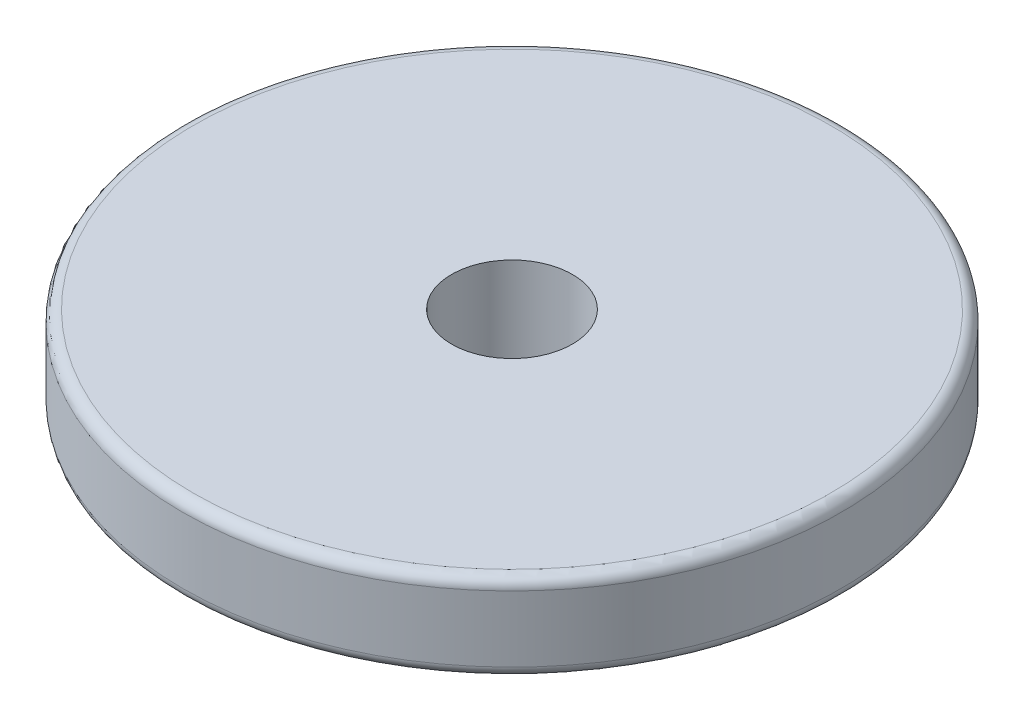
ISO-10303-21;
HEADER;
FILE_DESCRIPTION(('STEP AP214'),'2;1');
FILE_NAME('part.step','',(''),(''),'','','');
FILE_SCHEMA(('AUTOMOTIVE_DESIGN { 1 0 10303 214 1 1 1 1 }'));
ENDSEC;
DATA;
#1=APPLICATION_CONTEXT('core data for automotive mechanical design processes');
#2=APPLICATION_PROTOCOL_DEFINITION('international standard','automotive_design',2000,#1);
#3=PRODUCT_CONTEXT('',#1,'mechanical');
#4=PRODUCT('Part','Part','',(#3));
#5=PRODUCT_RELATED_PRODUCT_CATEGORY('part','',(#4));
#6=PRODUCT_DEFINITION_FORMATION('','',#4);
#7=PRODUCT_DEFINITION_CONTEXT('part definition',#1,'design');
#8=PRODUCT_DEFINITION('design','',#6,#7);
#9=PRODUCT_DEFINITION_SHAPE('','',#8);
#10=(LENGTH_UNIT() NAMED_UNIT(*) SI_UNIT(.MILLI.,.METRE.));
#11=(NAMED_UNIT(*) PLANE_ANGLE_UNIT() SI_UNIT($,.RADIAN.));
#12=(NAMED_UNIT(*) SI_UNIT($,.STERADIAN.) SOLID_ANGLE_UNIT());
#13=UNCERTAINTY_MEASURE_WITH_UNIT(LENGTH_MEASURE(1.E-05),#10,'distance_accuracy_value','');
#14=(GEOMETRIC_REPRESENTATION_CONTEXT(3) GLOBAL_UNCERTAINTY_ASSIGNED_CONTEXT((#13)) GLOBAL_UNIT_ASSIGNED_CONTEXT((#10,
#11,#12)) REPRESENTATION_CONTEXT('',''));
#15=CARTESIAN_POINT('',(0.,0.,0.));
#16=DIRECTION('',(0.,0.,1.));
#17=DIRECTION('',(1.,0.,0.));
#18=AXIS2_PLACEMENT_3D('',#15,#16,#17);
#19=CARTESIAN_POINT('',(0.,4.,0.));
#20=DIRECTION('',(0.,1.,0.));
#21=DIRECTION('',(0.,0.,1.));
#22=AXIS2_PLACEMENT_3D('',#19,#20,#21);
#23=PLANE('',#22);
#24=CARTESIAN_POINT('',(0.,4.,0.));
#25=DIRECTION('',(0.,1.,0.));
#26=DIRECTION('',(0.,0.,1.));
#27=AXIS2_PLACEMENT_3D('',#24,#25,#26);
#28=CIRCLE('',#27,14.5);
#29=CARTESIAN_POINT('',(0.,4.,14.5));
#30=VERTEX_POINT('',#29);
#31=EDGE_CURVE('E10',#30,#30,#28,.T.);
#32=ORIENTED_EDGE('',*,*,#31,.T.);
#33=EDGE_LOOP('',(#32));
#34=FACE_BOUND('',#33,.T.);
#35=CARTESIAN_POINT('',(0.,4.,0.));
#36=DIRECTION('',(0.,1.,0.));
#37=DIRECTION('',(0.,0.,1.));
#38=AXIS2_PLACEMENT_3D('',#35,#36,#37);
#39=CIRCLE('',#38,2.75);
#40=CARTESIAN_POINT('',(0.,4.,2.75));
#41=VERTEX_POINT('',#40);
#42=EDGE_CURVE('E48',#41,#41,#39,.T.);
#43=ORIENTED_EDGE('',*,*,#42,.F.);
#44=EDGE_LOOP('',(#43));
#45=FACE_BOUND('',#44,.T.);
#46=ADVANCED_FACE('F28',(#34,#45),#23,.T.);
#47=CARTESIAN_POINT('',(0.,0.,0.));
#48=DIRECTION('',(0.,1.,0.));
#49=DIRECTION('',(0.,0.,1.));
#50=AXIS2_PLACEMENT_3D('',#47,#48,#49);
#51=PLANE('',#50);
#52=CARTESIAN_POINT('',(0.,0.,0.));
#53=DIRECTION('',(0.,1.,0.));
#54=DIRECTION('',(0.,0.,1.));
#55=AXIS2_PLACEMENT_3D('',#52,#53,#54);
#56=CIRCLE('',#55,14.5);
#57=CARTESIAN_POINT('',(0.,0.,14.5));
#58=VERTEX_POINT('',#57);
#59=EDGE_CURVE('E35',#58,#58,#56,.F.);
#60=ORIENTED_EDGE('',*,*,#59,.T.);
#61=EDGE_LOOP('',(#60));
#62=FACE_BOUND('',#61,.T.);
#63=CARTESIAN_POINT('',(0.,0.,0.));
#64=DIRECTION('',(0.,1.,0.));
#65=DIRECTION('',(0.,0.,1.));
#66=AXIS2_PLACEMENT_3D('',#63,#64,#65);
#67=CIRCLE('',#66,2.75);
#68=CARTESIAN_POINT('',(0.,0.,2.75));
#69=VERTEX_POINT('',#68);
#70=EDGE_CURVE('E49',#69,#69,#67,.T.);
#71=ORIENTED_EDGE('',*,*,#70,.T.);
#72=EDGE_LOOP('',(#71));
#73=FACE_BOUND('',#72,.T.);
#74=ADVANCED_FACE('F59',(#62,#73),#51,.F.);
#75=CARTESIAN_POINT('',(0.,4.,0.));
#76=DIRECTION('',(0.,-1.,0.));
#77=DIRECTION('',(0.,0.,-1.));
#78=AXIS2_PLACEMENT_3D('',#75,#76,#77);
#79=CYLINDRICAL_SURFACE('',#78,15.);
#80=CARTESIAN_POINT('',(0.,0.5,0.));
#81=DIRECTION('',(0.,1.,0.));
#82=DIRECTION('',(0.,0.,1.));
#83=AXIS2_PLACEMENT_3D('',#80,#81,#82);
#84=CIRCLE('',#83,15.);
#85=CARTESIAN_POINT('',(0.,0.5,15.));
#86=VERTEX_POINT('',#85);
#87=EDGE_CURVE('E39',#86,#86,#84,.T.);
#88=ORIENTED_EDGE('',*,*,#87,.T.);
#89=EDGE_LOOP('',(#88));
#90=FACE_BOUND('',#89,.T.);
#91=CARTESIAN_POINT('',(0.,3.5,0.));
#92=DIRECTION('',(0.,1.,0.));
#93=DIRECTION('',(0.,0.,1.));
#94=AXIS2_PLACEMENT_3D('',#91,#92,#93);
#95=CIRCLE('',#94,15.);
#96=CARTESIAN_POINT('',(0.,3.5,15.));
#97=VERTEX_POINT('',#96);
#98=EDGE_CURVE('E43',#97,#97,#95,.F.);
#99=ORIENTED_EDGE('',*,*,#98,.T.);
#100=EDGE_LOOP('',(#99));
#101=FACE_BOUND('',#100,.T.);
#102=ADVANCED_FACE('F64',(#90,#101),#79,.T.);
#103=CARTESIAN_POINT('',(0.,4.,0.));
#104=DIRECTION('',(0.,-1.,0.));
#105=DIRECTION('',(0.,0.,-1.));
#106=AXIS2_PLACEMENT_3D('',#103,#104,#105);
#107=CYLINDRICAL_SURFACE('',#106,2.75);
#108=ORIENTED_EDGE('',*,*,#42,.T.);
#109=EDGE_LOOP('',(#108));
#110=FACE_BOUND('',#109,.T.);
#111=ORIENTED_EDGE('',*,*,#70,.F.);
#112=EDGE_LOOP('',(#111));
#113=FACE_BOUND('',#112,.T.);
#114=ADVANCED_FACE('F55',(#110,#113),#107,.F.);
#115=CARTESIAN_POINT('',(0.,0.5,0.));
#116=DIRECTION('',(0.,1.,0.));
#117=DIRECTION('',(0.,0.,1.));
#118=AXIS2_PLACEMENT_3D('',#115,#116,#117);
#119=TOROIDAL_SURFACE('',#118,14.5,0.5);
#120=ORIENTED_EDGE('',*,*,#59,.F.);
#121=EDGE_LOOP('',(#120));
#122=FACE_BOUND('',#121,.T.);
#123=ORIENTED_EDGE('',*,*,#87,.F.);
#124=EDGE_LOOP('',(#123));
#125=FACE_BOUND('',#124,.T.);
#126=ADVANCED_FACE('F70',(#122,#125),#119,.T.);
#127=CARTESIAN_POINT('',(0.,3.5,0.));
#128=DIRECTION('',(0.,1.,0.));
#129=DIRECTION('',(0.,0.,1.));
#130=AXIS2_PLACEMENT_3D('',#127,#128,#129);
#131=TOROIDAL_SURFACE('',#130,14.5,0.5);
#132=ORIENTED_EDGE('',*,*,#98,.F.);
#133=EDGE_LOOP('',(#132));
#134=FACE_BOUND('',#133,.T.);
#135=ORIENTED_EDGE('',*,*,#31,.F.);
#136=EDGE_LOOP('',(#135));
#137=FACE_BOUND('',#136,.T.);
#138=ADVANCED_FACE('F30',(#134,#137),#131,.T.);
#139=CLOSED_SHELL('',(#46,#74,#102,#114,#126,#138));
#140=MANIFOLD_SOLID_BREP('B2',#139);
#141=ADVANCED_BREP_SHAPE_REPRESENTATION('',(#18,#140),#14);
#142=SHAPE_DEFINITION_REPRESENTATION(#9,#141);
ENDSEC;
END-ISO-10303-21;
